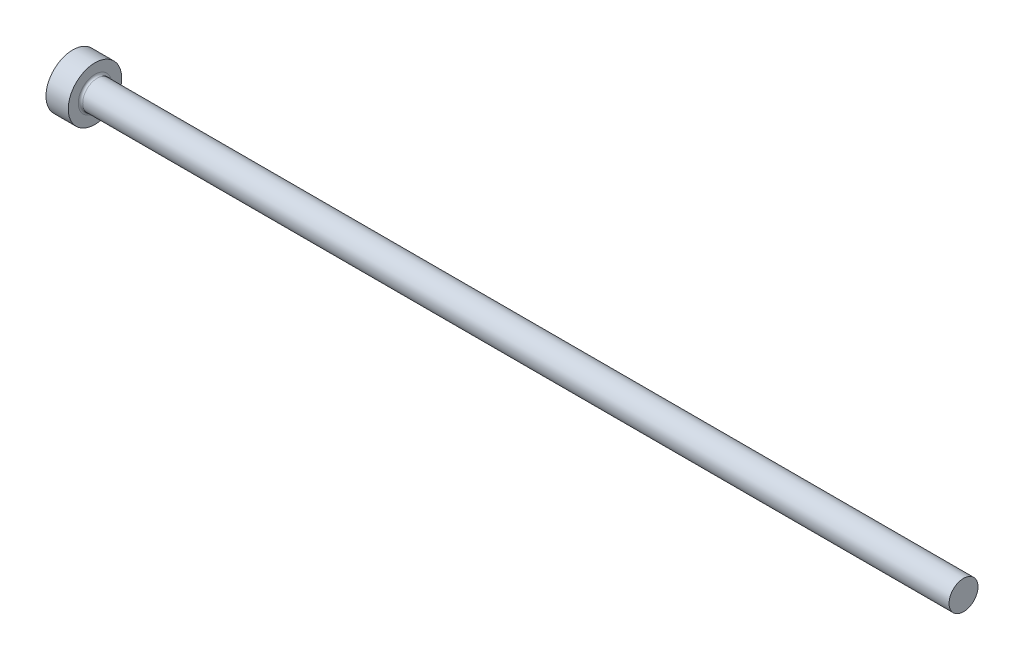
ISO-10303-21;
HEADER;
FILE_DESCRIPTION(('STEP AP214'),'2;1');
FILE_NAME('part.step','',(''),(''),'','','');
FILE_SCHEMA(('AUTOMOTIVE_DESIGN { 1 0 10303 214 1 1 1 1 }'));
ENDSEC;
DATA;
#1=APPLICATION_CONTEXT('core data for automotive mechanical design processes');
#2=APPLICATION_PROTOCOL_DEFINITION('international standard','automotive_design',2000,#1);
#3=PRODUCT_CONTEXT('',#1,'mechanical');
#4=PRODUCT('Part','Part','',(#3));
#5=PRODUCT_RELATED_PRODUCT_CATEGORY('part','',(#4));
#6=PRODUCT_DEFINITION_FORMATION('','',#4);
#7=PRODUCT_DEFINITION_CONTEXT('part definition',#1,'design');
#8=PRODUCT_DEFINITION('design','',#6,#7);
#9=PRODUCT_DEFINITION_SHAPE('','',#8);
#10=(LENGTH_UNIT() NAMED_UNIT(*) SI_UNIT(.MILLI.,.METRE.));
#11=(NAMED_UNIT(*) PLANE_ANGLE_UNIT() SI_UNIT($,.RADIAN.));
#12=(NAMED_UNIT(*) SI_UNIT($,.STERADIAN.) SOLID_ANGLE_UNIT());
#13=UNCERTAINTY_MEASURE_WITH_UNIT(LENGTH_MEASURE(1.E-05),#10,'distance_accuracy_value','');
#14=(GEOMETRIC_REPRESENTATION_CONTEXT(3) GLOBAL_UNCERTAINTY_ASSIGNED_CONTEXT((#13)) GLOBAL_UNIT_ASSIGNED_CONTEXT((#10,
#11,#12)) REPRESENTATION_CONTEXT('',''));
#15=CARTESIAN_POINT('',(0.,0.,0.));
#16=DIRECTION('',(0.,0.,1.));
#17=DIRECTION('',(1.,0.,0.));
#18=AXIS2_PLACEMENT_3D('',#15,#16,#17);
#19=CARTESIAN_POINT('',(0.,0.,0.));
#20=DIRECTION('',(-1.,0.,0.));
#21=DIRECTION('',(0.,-1.,0.));
#22=AXIS2_PLACEMENT_3D('',#19,#20,#21);
#23=PLANE('',#22);
#24=CARTESIAN_POINT('',(0.,0.,0.));
#25=DIRECTION('',(1.,0.,0.));
#26=DIRECTION('',(0.,1.,0.));
#27=AXIS2_PLACEMENT_3D('',#24,#25,#26);
#28=CIRCLE('',#27,6.);
#29=CARTESIAN_POINT('',(0.,6.,0.));
#30=VERTEX_POINT('',#29);
#31=EDGE_CURVE('E25',#30,#30,#28,.T.);
#32=ORIENTED_EDGE('',*,*,#31,.F.);
#33=EDGE_LOOP('',(#32));
#34=FACE_BOUND('',#33,.T.);
#35=ADVANCED_FACE('F14',(#34),#23,.T.);
#36=CARTESIAN_POINT('',(200.,0.,0.));
#37=DIRECTION('',(1.,0.,0.));
#38=DIRECTION('',(0.,1.,0.));
#39=AXIS2_PLACEMENT_3D('',#36,#37,#38);
#40=CYLINDRICAL_SURFACE('',#39,6.);
#41=ORIENTED_EDGE('',*,*,#31,.T.);
#42=EDGE_LOOP('',(#41));
#43=FACE_BOUND('',#42,.T.);
#44=CARTESIAN_POINT('',(5.,0.,0.));
#45=DIRECTION('',(1.,0.,0.));
#46=DIRECTION('',(0.,1.,0.));
#47=AXIS2_PLACEMENT_3D('',#44,#45,#46);
#48=CIRCLE('',#47,6.);
#49=CARTESIAN_POINT('',(5.,6.,0.));
#50=VERTEX_POINT('',#49);
#51=EDGE_CURVE('E29',#50,#50,#48,.T.);
#52=ORIENTED_EDGE('',*,*,#51,.F.);
#53=EDGE_LOOP('',(#52));
#54=FACE_BOUND('',#53,.T.);
#55=ADVANCED_FACE('F51',(#43,#54),#40,.T.);
#56=CARTESIAN_POINT('',(5.,6.,0.));
#57=DIRECTION('',(1.,0.,0.));
#58=DIRECTION('',(0.,1.,0.));
#59=AXIS2_PLACEMENT_3D('',#56,#57,#58);
#60=PLANE('',#59);
#61=CARTESIAN_POINT('',(5.,0.,0.));
#62=DIRECTION('',(1.,0.,0.));
#63=DIRECTION('',(0.,1.,0.));
#64=AXIS2_PLACEMENT_3D('',#61,#62,#63);
#65=CIRCLE('',#64,3.74999999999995);
#66=CARTESIAN_POINT('',(5.,3.74999999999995,0.));
#67=VERTEX_POINT('',#66);
#68=EDGE_CURVE('E9',#67,#67,#65,.F.);
#69=ORIENTED_EDGE('',*,*,#68,.T.);
#70=EDGE_LOOP('',(#69));
#71=FACE_BOUND('',#70,.T.);
#72=ORIENTED_EDGE('',*,*,#51,.T.);
#73=EDGE_LOOP('',(#72));
#74=FACE_BOUND('',#73,.T.);
#75=ADVANCED_FACE('F42',(#71,#74),#60,.T.);
#76=CARTESIAN_POINT('',(200.,0.,0.));
#77=DIRECTION('',(1.,0.,0.));
#78=DIRECTION('',(0.,1.,0.));
#79=AXIS2_PLACEMENT_3D('',#76,#77,#78);
#80=CYLINDRICAL_SURFACE('',#79,3.24999999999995);
#81=CARTESIAN_POINT('',(5.5,0.,0.));
#82=DIRECTION('',(1.,0.,0.));
#83=DIRECTION('',(0.,1.,0.));
#84=AXIS2_PLACEMENT_3D('',#81,#82,#83);
#85=CIRCLE('',#84,3.24999999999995);
#86=CARTESIAN_POINT('',(5.5,3.24999999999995,0.));
#87=VERTEX_POINT('',#86);
#88=EDGE_CURVE('E21',#87,#87,#85,.T.);
#89=ORIENTED_EDGE('',*,*,#88,.T.);
#90=EDGE_LOOP('',(#89));
#91=FACE_BOUND('',#90,.T.);
#92=CARTESIAN_POINT('',(200.,0.,0.));
#93=DIRECTION('',(1.,0.,0.));
#94=DIRECTION('',(0.,1.,0.));
#95=AXIS2_PLACEMENT_3D('',#92,#93,#94);
#96=CIRCLE('',#95,3.25);
#97=CARTESIAN_POINT('',(200.,3.25,0.));
#98=VERTEX_POINT('',#97);
#99=EDGE_CURVE('E34',#98,#98,#96,.T.);
#100=ORIENTED_EDGE('',*,*,#99,.F.);
#101=EDGE_LOOP('',(#100));
#102=FACE_BOUND('',#101,.T.);
#103=ADVANCED_FACE('F40',(#91,#102),#80,.T.);
#104=CARTESIAN_POINT('',(200.,3.25,0.));
#105=DIRECTION('',(1.,0.,0.));
#106=DIRECTION('',(0.,1.,0.));
#107=AXIS2_PLACEMENT_3D('',#104,#105,#106);
#108=PLANE('',#107);
#109=ORIENTED_EDGE('',*,*,#99,.T.);
#110=EDGE_LOOP('',(#109));
#111=FACE_BOUND('',#110,.T.);
#112=ADVANCED_FACE('F38',(#111),#108,.T.);
#113=CARTESIAN_POINT('',(5.5,0.,0.));
#114=DIRECTION('',(1.,0.,0.));
#115=DIRECTION('',(0.,1.,0.));
#116=AXIS2_PLACEMENT_3D('',#113,#114,#115);
#117=TOROIDAL_SURFACE('',#116,3.74999999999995,0.5);
#118=ORIENTED_EDGE('',*,*,#68,.F.);
#119=EDGE_LOOP('',(#118));
#120=FACE_BOUND('',#119,.T.);
#121=ORIENTED_EDGE('',*,*,#88,.F.);
#122=EDGE_LOOP('',(#121));
#123=FACE_BOUND('',#122,.T.);
#124=ADVANCED_FACE('F16',(#120,#123),#117,.F.);
#125=CLOSED_SHELL('',(#35,#55,#75,#103,#112,#124));
#126=MANIFOLD_SOLID_BREP('B1',#125);
#127=ADVANCED_BREP_SHAPE_REPRESENTATION('',(#18,#126),#14);
#128=SHAPE_DEFINITION_REPRESENTATION(#9,#127);
ENDSEC;
END-ISO-10303-21;
